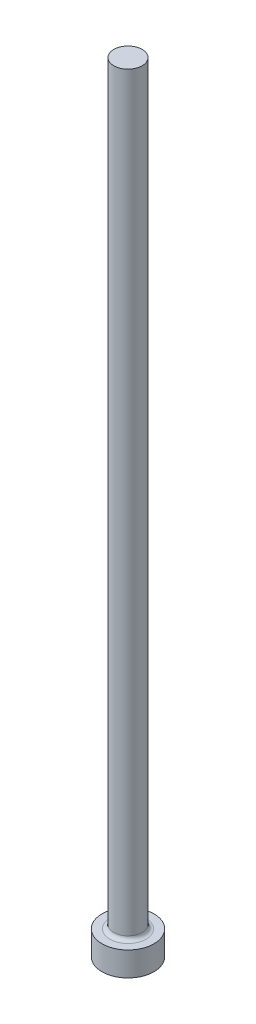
ISO-10303-21;
HEADER;
FILE_DESCRIPTION(('STEP AP214'),'2;1');
FILE_NAME('part.step','',(''),(''),'','','');
FILE_SCHEMA(('AUTOMOTIVE_DESIGN { 1 0 10303 214 1 1 1 1 }'));
ENDSEC;
DATA;
#1=APPLICATION_CONTEXT('core data for automotive mechanical design processes');
#2=APPLICATION_PROTOCOL_DEFINITION('international standard','automotive_design',2000,#1);
#3=PRODUCT_CONTEXT('',#1,'mechanical');
#4=PRODUCT('Part','Part','',(#3));
#5=PRODUCT_RELATED_PRODUCT_CATEGORY('part','',(#4));
#6=PRODUCT_DEFINITION_FORMATION('','',#4);
#7=PRODUCT_DEFINITION_CONTEXT('part definition',#1,'design');
#8=PRODUCT_DEFINITION('design','',#6,#7);
#9=PRODUCT_DEFINITION_SHAPE('','',#8);
#10=(LENGTH_UNIT() NAMED_UNIT(*) SI_UNIT(.MILLI.,.METRE.));
#11=(NAMED_UNIT(*) PLANE_ANGLE_UNIT() SI_UNIT($,.RADIAN.));
#12=(NAMED_UNIT(*) SI_UNIT($,.STERADIAN.) SOLID_ANGLE_UNIT());
#13=UNCERTAINTY_MEASURE_WITH_UNIT(LENGTH_MEASURE(1.E-05),#10,'distance_accuracy_value','');
#14=(GEOMETRIC_REPRESENTATION_CONTEXT(3) GLOBAL_UNCERTAINTY_ASSIGNED_CONTEXT((#13)) GLOBAL_UNIT_ASSIGNED_CONTEXT((#10,
#11,#12)) REPRESENTATION_CONTEXT('',''));
#15=CARTESIAN_POINT('',(0.,0.,0.));
#16=DIRECTION('',(0.,0.,1.));
#17=DIRECTION('',(1.,0.,0.));
#18=AXIS2_PLACEMENT_3D('',#15,#16,#17);
#19=CARTESIAN_POINT('',(2.77749000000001,152.4,0.));
#20=DIRECTION('',(0.,-1.,0.));
#21=DIRECTION('',(1.,0.,0.));
#22=AXIS2_PLACEMENT_3D('',#19,#20,#21);
#23=PLANE('',#22);
#24=CARTESIAN_POINT('',(0.,152.4,0.));
#25=DIRECTION('',(0.,1.,0.));
#26=DIRECTION('',(-1.,0.,0.));
#27=AXIS2_PLACEMENT_3D('',#24,#25,#26);
#28=CIRCLE('',#27,2.77749);
#29=CARTESIAN_POINT('',(-2.77748999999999,152.4,0.));
#30=VERTEX_POINT('',#29);
#31=EDGE_CURVE('E10',#30,#30,#28,.T.);
#32=ORIENTED_EDGE('',*,*,#31,.T.);
#33=EDGE_LOOP('',(#32));
#34=FACE_BOUND('',#33,.T.);
#35=ADVANCED_FACE('F30',(#34),#23,.F.);
#36=CARTESIAN_POINT('',(0.,152.4,0.));
#37=DIRECTION('',(0.,1.,0.));
#38=DIRECTION('',(-1.,0.,0.));
#39=AXIS2_PLACEMENT_3D('',#36,#37,#38);
#40=CYLINDRICAL_SURFACE('',#39,2.77749);
#41=ORIENTED_EDGE('',*,*,#31,.F.);
#42=EDGE_LOOP('',(#41));
#43=FACE_BOUND('',#42,.T.);
#44=CARTESIAN_POINT('',(0.,5.51180000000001,0.));
#45=DIRECTION('',(0.,1.,0.));
#46=DIRECTION('',(-1.,0.,0.));
#47=AXIS2_PLACEMENT_3D('',#44,#45,#46);
#48=CIRCLE('',#47,2.77749);
#49=CARTESIAN_POINT('',(-2.77749,5.51180000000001,0.));
#50=VERTEX_POINT('',#49);
#51=EDGE_CURVE('E36',#50,#50,#48,.T.);
#52=ORIENTED_EDGE('',*,*,#51,.T.);
#53=EDGE_LOOP('',(#52));
#54=FACE_BOUND('',#53,.T.);
#55=ADVANCED_FACE('F65',(#43,#54),#40,.T.);
#56=CARTESIAN_POINT('',(0.,5.5118,0.));
#57=DIRECTION('',(0.,1.,0.));
#58=DIRECTION('',(-1.,0.,0.));
#59=AXIS2_PLACEMENT_3D('',#56,#57,#58);
#60=TOROIDAL_SURFACE('',#59,3.53949,0.762);
#61=ORIENTED_EDGE('',*,*,#51,.F.);
#62=EDGE_LOOP('',(#61));
#63=FACE_BOUND('',#62,.T.);
#64=CARTESIAN_POINT('',(0.,4.7498,0.));
#65=DIRECTION('',(0.,1.,0.));
#66=DIRECTION('',(-1.,0.,0.));
#67=AXIS2_PLACEMENT_3D('',#64,#65,#66);
#68=CIRCLE('',#67,3.53949);
#69=CARTESIAN_POINT('',(-3.53949,4.7498,0.));
#70=VERTEX_POINT('',#69);
#71=EDGE_CURVE('E40',#70,#70,#68,.T.);
#72=ORIENTED_EDGE('',*,*,#71,.T.);
#73=EDGE_LOOP('',(#72));
#74=FACE_BOUND('',#73,.T.);
#75=ADVANCED_FACE('F69',(#63,#74),#60,.F.);
#76=CARTESIAN_POINT('',(5.08,4.7498,0.));
#77=DIRECTION('',(0.,-1.,0.));
#78=DIRECTION('',(1.,0.,0.));
#79=AXIS2_PLACEMENT_3D('',#76,#77,#78);
#80=PLANE('',#79);
#81=ORIENTED_EDGE('',*,*,#71,.F.);
#82=EDGE_LOOP('',(#81));
#83=FACE_BOUND('',#82,.T.);
#84=CARTESIAN_POINT('',(0.,4.7498,0.));
#85=DIRECTION('',(0.,1.,0.));
#86=DIRECTION('',(-1.,0.,0.));
#87=AXIS2_PLACEMENT_3D('',#84,#85,#86);
#88=CIRCLE('',#87,5.08);
#89=CARTESIAN_POINT('',(-5.08,4.7498,0.));
#90=VERTEX_POINT('',#89);
#91=EDGE_CURVE('E44',#90,#90,#88,.T.);
#92=ORIENTED_EDGE('',*,*,#91,.T.);
#93=EDGE_LOOP('',(#92));
#94=FACE_BOUND('',#93,.T.);
#95=ADVANCED_FACE('F61',(#83,#94),#80,.F.);
#96=CARTESIAN_POINT('',(0.,152.4,0.));
#97=DIRECTION('',(0.,1.,0.));
#98=DIRECTION('',(-1.,0.,0.));
#99=AXIS2_PLACEMENT_3D('',#96,#97,#98);
#100=CYLINDRICAL_SURFACE('',#99,5.08);
#101=ORIENTED_EDGE('',*,*,#91,.F.);
#102=EDGE_LOOP('',(#101));
#103=FACE_BOUND('',#102,.T.);
#104=CARTESIAN_POINT('',(0.,0.,0.));
#105=DIRECTION('',(0.,1.,0.));
#106=DIRECTION('',(-1.,0.,0.));
#107=AXIS2_PLACEMENT_3D('',#104,#105,#106);
#108=CIRCLE('',#107,5.08);
#109=CARTESIAN_POINT('',(-5.08,0.,0.));
#110=VERTEX_POINT('',#109);
#111=EDGE_CURVE('E49',#110,#110,#108,.T.);
#112=ORIENTED_EDGE('',*,*,#111,.T.);
#113=EDGE_LOOP('',(#112));
#114=FACE_BOUND('',#113,.T.);
#115=ADVANCED_FACE('F53',(#103,#114),#100,.T.);
#116=CARTESIAN_POINT('',(0.,0.,0.));
#117=DIRECTION('',(0.,1.,0.));
#118=DIRECTION('',(-1.,0.,0.));
#119=AXIS2_PLACEMENT_3D('',#116,#117,#118);
#120=PLANE('',#119);
#121=ORIENTED_EDGE('',*,*,#111,.F.);
#122=EDGE_LOOP('',(#121));
#123=FACE_BOUND('',#122,.T.);
#124=ADVANCED_FACE('F55',(#123),#120,.F.);
#125=CLOSED_SHELL('',(#35,#55,#75,#95,#115,#124));
#126=MANIFOLD_SOLID_BREP('B2',#125);
#127=ADVANCED_BREP_SHAPE_REPRESENTATION('',(#18,#126),#14);
#128=SHAPE_DEFINITION_REPRESENTATION(#9,#127);
ENDSEC;
END-ISO-10303-21;
